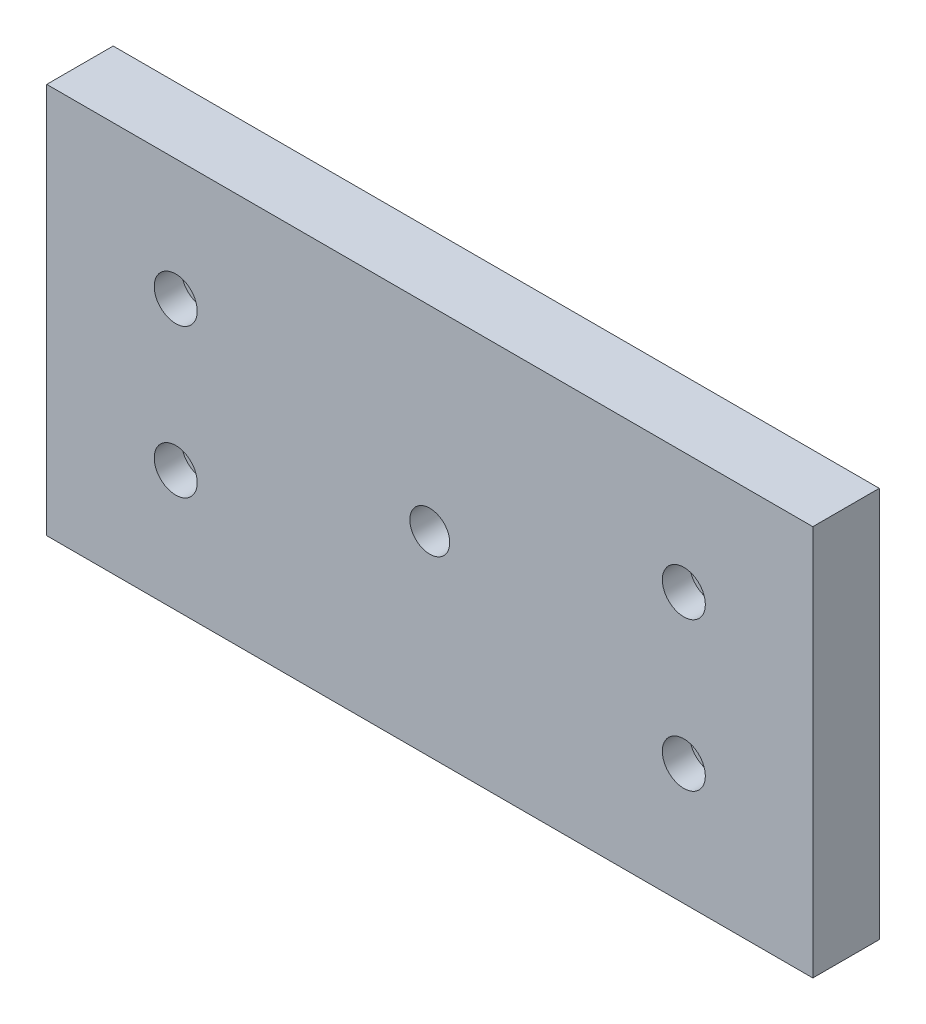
ISO-10303-21;
HEADER;
FILE_DESCRIPTION(('STEP AP214'),'2;1');
FILE_NAME('part.step','',(''),(''),'','','');
FILE_SCHEMA(('AUTOMOTIVE_DESIGN { 1 0 10303 214 1 1 1 1 }'));
ENDSEC;
DATA;
#1=APPLICATION_CONTEXT('core data for automotive mechanical design processes');
#2=APPLICATION_PROTOCOL_DEFINITION('international standard','automotive_design',2000,#1);
#3=PRODUCT_CONTEXT('',#1,'mechanical');
#4=PRODUCT('Part','Part','',(#3));
#5=PRODUCT_RELATED_PRODUCT_CATEGORY('part','',(#4));
#6=PRODUCT_DEFINITION_FORMATION('','',#4);
#7=PRODUCT_DEFINITION_CONTEXT('part definition',#1,'design');
#8=PRODUCT_DEFINITION('design','',#6,#7);
#9=PRODUCT_DEFINITION_SHAPE('','',#8);
#10=(LENGTH_UNIT() NAMED_UNIT(*) SI_UNIT(.MILLI.,.METRE.));
#11=(NAMED_UNIT(*) PLANE_ANGLE_UNIT() SI_UNIT($,.RADIAN.));
#12=(NAMED_UNIT(*) SI_UNIT($,.STERADIAN.) SOLID_ANGLE_UNIT());
#13=UNCERTAINTY_MEASURE_WITH_UNIT(LENGTH_MEASURE(1.E-05),#10,'distance_accuracy_value','');
#14=(GEOMETRIC_REPRESENTATION_CONTEXT(3) GLOBAL_UNCERTAINTY_ASSIGNED_CONTEXT((#13)) GLOBAL_UNIT_ASSIGNED_CONTEXT((#10,
#11,#12)) REPRESENTATION_CONTEXT('',''));
#15=CARTESIAN_POINT('',(0.,0.,0.));
#16=DIRECTION('',(0.,0.,1.));
#17=DIRECTION('',(1.,0.,0.));
#18=AXIS2_PLACEMENT_3D('',#15,#16,#17);
#19=CARTESIAN_POINT('',(0.,0.,17.));
#20=DIRECTION('',(1.,0.,0.));
#21=DIRECTION('',(0.,0.,-1.));
#22=AXIS2_PLACEMENT_3D('',#19,#20,#21);
#23=PLANE('',#22);
#24=DIRECTION('',(0.,-1.,0.));
#25=VECTOR('',#24,1.);
#26=CARTESIAN_POINT('',(0.,0.,0.));
#27=LINE('',#26,#25);
#28=CARTESIAN_POINT('',(0.,100.,0.));
#29=VERTEX_POINT('',#28);
#30=CARTESIAN_POINT('',(0.,0.,0.));
#31=VERTEX_POINT('',#30);
#32=EDGE_CURVE('E96',#29,#31,#27,.T.);
#33=ORIENTED_EDGE('',*,*,#32,.T.);
#34=DIRECTION('',(0.,0.,-1.));
#35=VECTOR('',#34,1.);
#36=CARTESIAN_POINT('',(0.,0.,17.));
#37=LINE('',#36,#35);
#38=CARTESIAN_POINT('',(0.,0.,17.));
#39=VERTEX_POINT('',#38);
#40=EDGE_CURVE('E11',#39,#31,#37,.T.);
#41=ORIENTED_EDGE('',*,*,#40,.F.);
#42=DIRECTION('',(0.,-1.,0.));
#43=VECTOR('',#42,1.);
#44=CARTESIAN_POINT('',(0.,0.,17.));
#45=LINE('',#44,#43);
#46=CARTESIAN_POINT('',(0.,100.,17.));
#47=VERTEX_POINT('',#46);
#48=EDGE_CURVE('E111',#47,#39,#45,.T.);
#49=ORIENTED_EDGE('',*,*,#48,.F.);
#50=DIRECTION('',(0.,0.,-1.));
#51=VECTOR('',#50,1.);
#52=CARTESIAN_POINT('',(0.,100.,17.));
#53=LINE('',#52,#51);
#54=EDGE_CURVE('E117',#47,#29,#53,.T.);
#55=ORIENTED_EDGE('',*,*,#54,.T.);
#56=EDGE_LOOP('',(#33,#41,#49,#55));
#57=FACE_BOUND('',#56,.T.);
#58=ADVANCED_FACE('F41',(#57),#23,.F.);
#59=CARTESIAN_POINT('',(0.,0.,17.));
#60=DIRECTION('',(0.,1.,0.));
#61=DIRECTION('',(0.,0.,1.));
#62=AXIS2_PLACEMENT_3D('',#59,#60,#61);
#63=PLANE('',#62);
#64=DIRECTION('',(1.,0.,0.));
#65=VECTOR('',#64,1.);
#66=CARTESIAN_POINT('',(0.,0.,0.));
#67=LINE('',#66,#65);
#68=CARTESIAN_POINT('',(196.,0.,0.));
#69=VERTEX_POINT('',#68);
#70=EDGE_CURVE('E105',#31,#69,#67,.T.);
#71=ORIENTED_EDGE('',*,*,#70,.T.);
#72=DIRECTION('',(0.,0.,-1.));
#73=VECTOR('',#72,1.);
#74=CARTESIAN_POINT('',(196.,0.,17.));
#75=LINE('',#74,#73);
#76=CARTESIAN_POINT('',(196.,0.,17.));
#77=VERTEX_POINT('',#76);
#78=EDGE_CURVE('E48',#77,#69,#75,.T.);
#79=ORIENTED_EDGE('',*,*,#78,.F.);
#80=DIRECTION('',(1.,0.,0.));
#81=VECTOR('',#80,1.);
#82=CARTESIAN_POINT('',(0.,0.,17.));
#83=LINE('',#82,#81);
#84=EDGE_CURVE('E113',#39,#77,#83,.T.);
#85=ORIENTED_EDGE('',*,*,#84,.F.);
#86=ORIENTED_EDGE('',*,*,#40,.T.);
#87=EDGE_LOOP('',(#71,#79,#85,#86));
#88=FACE_BOUND('',#87,.T.);
#89=ADVANCED_FACE('F138',(#88),#63,.F.);
#90=CARTESIAN_POINT('',(196.,0.,17.));
#91=DIRECTION('',(-1.,0.,0.));
#92=DIRECTION('',(0.,0.,1.));
#93=AXIS2_PLACEMENT_3D('',#90,#91,#92);
#94=PLANE('',#93);
#95=DIRECTION('',(0.,1.,0.));
#96=VECTOR('',#95,1.);
#97=CARTESIAN_POINT('',(196.,0.,0.));
#98=LINE('',#97,#96);
#99=CARTESIAN_POINT('',(196.,100.,0.));
#100=VERTEX_POINT('',#99);
#101=EDGE_CURVE('E107',#69,#100,#98,.T.);
#102=ORIENTED_EDGE('',*,*,#101,.T.);
#103=DIRECTION('',(0.,0.,-1.));
#104=VECTOR('',#103,1.);
#105=CARTESIAN_POINT('',(196.,100.,17.));
#106=LINE('',#105,#104);
#107=CARTESIAN_POINT('',(196.,100.,17.));
#108=VERTEX_POINT('',#107);
#109=EDGE_CURVE('E120',#108,#100,#106,.T.);
#110=ORIENTED_EDGE('',*,*,#109,.F.);
#111=DIRECTION('',(0.,1.,0.));
#112=VECTOR('',#111,1.);
#113=CARTESIAN_POINT('',(196.,0.,17.));
#114=LINE('',#113,#112);
#115=EDGE_CURVE('E60',#77,#108,#114,.T.);
#116=ORIENTED_EDGE('',*,*,#115,.F.);
#117=ORIENTED_EDGE('',*,*,#78,.T.);
#118=EDGE_LOOP('',(#102,#110,#116,#117));
#119=FACE_BOUND('',#118,.T.);
#120=ADVANCED_FACE('F126',(#119),#94,.F.);
#121=CARTESIAN_POINT('',(0.,100.,17.));
#122=DIRECTION('',(0.,-1.,0.));
#123=DIRECTION('',(0.,0.,-1.));
#124=AXIS2_PLACEMENT_3D('',#121,#122,#123);
#125=PLANE('',#124);
#126=DIRECTION('',(-1.,0.,0.));
#127=VECTOR('',#126,1.);
#128=CARTESIAN_POINT('',(0.,100.,0.));
#129=LINE('',#128,#127);
#130=EDGE_CURVE('E109',#100,#29,#129,.T.);
#131=ORIENTED_EDGE('',*,*,#130,.T.);
#132=ORIENTED_EDGE('',*,*,#54,.F.);
#133=DIRECTION('',(-1.,0.,0.));
#134=VECTOR('',#133,1.);
#135=CARTESIAN_POINT('',(0.,100.,17.));
#136=LINE('',#135,#134);
#137=EDGE_CURVE('E55',#108,#47,#136,.T.);
#138=ORIENTED_EDGE('',*,*,#137,.F.);
#139=ORIENTED_EDGE('',*,*,#109,.T.);
#140=EDGE_LOOP('',(#131,#132,#138,#139));
#141=FACE_BOUND('',#140,.T.);
#142=ADVANCED_FACE('F133',(#141),#125,.F.);
#143=CARTESIAN_POINT('',(0.,100.,17.));
#144=DIRECTION('',(0.,0.,-1.));
#145=DIRECTION('',(-1.,0.,0.));
#146=AXIS2_PLACEMENT_3D('',#143,#144,#145);
#147=PLANE('',#146);
#148=CARTESIAN_POINT('',(33.,69.,17.));
#149=DIRECTION('',(0.,0.,1.));
#150=DIRECTION('',(1.,0.,0.));
#151=AXIS2_PLACEMENT_3D('',#148,#149,#150);
#152=CIRCLE('',#151,5.49999999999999);
#153=CARTESIAN_POINT('',(38.5,69.,17.));
#154=VERTEX_POINT('',#153);
#155=EDGE_CURVE('E210',#154,#154,#152,.T.);
#156=ORIENTED_EDGE('',*,*,#155,.F.);
#157=EDGE_LOOP('',(#156));
#158=FACE_BOUND('',#157,.T.);
#159=CARTESIAN_POINT('',(163.,69.,17.));
#160=DIRECTION('',(0.,0.,1.));
#161=DIRECTION('',(1.,0.,0.));
#162=AXIS2_PLACEMENT_3D('',#159,#160,#161);
#163=CIRCLE('',#162,5.50000000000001);
#164=CARTESIAN_POINT('',(168.5,69.,17.));
#165=VERTEX_POINT('',#164);
#166=EDGE_CURVE('E220',#165,#165,#163,.T.);
#167=ORIENTED_EDGE('',*,*,#166,.F.);
#168=EDGE_LOOP('',(#167));
#169=FACE_BOUND('',#168,.T.);
#170=CARTESIAN_POINT('',(33.,31.,17.));
#171=DIRECTION('',(0.,0.,1.));
#172=DIRECTION('',(1.,0.,0.));
#173=AXIS2_PLACEMENT_3D('',#170,#171,#172);
#174=CIRCLE('',#173,5.49999999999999);
#175=CARTESIAN_POINT('',(38.5,31.,17.));
#176=VERTEX_POINT('',#175);
#177=EDGE_CURVE('E232',#176,#176,#174,.T.);
#178=ORIENTED_EDGE('',*,*,#177,.F.);
#179=EDGE_LOOP('',(#178));
#180=FACE_BOUND('',#179,.T.);
#181=CARTESIAN_POINT('',(163.,31.,17.));
#182=DIRECTION('',(0.,0.,1.));
#183=DIRECTION('',(1.,0.,0.));
#184=AXIS2_PLACEMENT_3D('',#181,#182,#183);
#185=CIRCLE('',#184,5.50000000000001);
#186=CARTESIAN_POINT('',(168.5,31.,17.));
#187=VERTEX_POINT('',#186);
#188=EDGE_CURVE('E244',#187,#187,#185,.T.);
#189=ORIENTED_EDGE('',*,*,#188,.F.);
#190=EDGE_LOOP('',(#189));
#191=FACE_BOUND('',#190,.T.);
#192=CARTESIAN_POINT('',(98.,50.,17.));
#193=DIRECTION('',(0.,0.,1.));
#194=DIRECTION('',(1.,0.,0.));
#195=AXIS2_PLACEMENT_3D('',#192,#193,#194);
#196=CIRCLE('',#195,5.09999999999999);
#197=CARTESIAN_POINT('',(103.1,50.,17.));
#198=VERTEX_POINT('',#197);
#199=EDGE_CURVE('E92',#198,#198,#196,.T.);
#200=ORIENTED_EDGE('',*,*,#199,.F.);
#201=EDGE_LOOP('',(#200));
#202=FACE_BOUND('',#201,.T.);
#203=ORIENTED_EDGE('',*,*,#48,.T.);
#204=ORIENTED_EDGE('',*,*,#84,.T.);
#205=ORIENTED_EDGE('',*,*,#115,.T.);
#206=ORIENTED_EDGE('',*,*,#137,.T.);
#207=EDGE_LOOP('',(#203,#204,#205,#206));
#208=FACE_BOUND('',#207,.T.);
#209=ADVANCED_FACE('F137',(#158,#169,#180,#191,#202,#208),#147,.F.);
#210=CARTESIAN_POINT('',(0.,100.,0.));
#211=DIRECTION('',(0.,0.,-1.));
#212=DIRECTION('',(-1.,0.,0.));
#213=AXIS2_PLACEMENT_3D('',#210,#211,#212);
#214=PLANE('',#213);
#215=CARTESIAN_POINT('',(33.,69.,0.));
#216=DIRECTION('',(0.,0.,1.));
#217=DIRECTION('',(1.,0.,0.));
#218=AXIS2_PLACEMENT_3D('',#215,#216,#217);
#219=CIRCLE('',#218,3.3);
#220=CARTESIAN_POINT('',(36.3,69.,0.));
#221=VERTEX_POINT('',#220);
#222=EDGE_CURVE('E217',#221,#221,#219,.T.);
#223=ORIENTED_EDGE('',*,*,#222,.T.);
#224=EDGE_LOOP('',(#223));
#225=FACE_BOUND('',#224,.T.);
#226=CARTESIAN_POINT('',(163.,69.,0.));
#227=DIRECTION('',(0.,0.,1.));
#228=DIRECTION('',(1.,0.,0.));
#229=AXIS2_PLACEMENT_3D('',#226,#227,#228);
#230=CIRCLE('',#229,3.3);
#231=CARTESIAN_POINT('',(166.3,69.,0.));
#232=VERTEX_POINT('',#231);
#233=EDGE_CURVE('E229',#232,#232,#230,.T.);
#234=ORIENTED_EDGE('',*,*,#233,.T.);
#235=EDGE_LOOP('',(#234));
#236=FACE_BOUND('',#235,.T.);
#237=CARTESIAN_POINT('',(33.,31.,0.));
#238=DIRECTION('',(0.,0.,1.));
#239=DIRECTION('',(1.,0.,0.));
#240=AXIS2_PLACEMENT_3D('',#237,#238,#239);
#241=CIRCLE('',#240,3.3);
#242=CARTESIAN_POINT('',(36.3,31.,0.));
#243=VERTEX_POINT('',#242);
#244=EDGE_CURVE('E241',#243,#243,#241,.T.);
#245=ORIENTED_EDGE('',*,*,#244,.T.);
#246=EDGE_LOOP('',(#245));
#247=FACE_BOUND('',#246,.T.);
#248=CARTESIAN_POINT('',(163.,31.,0.));
#249=DIRECTION('',(0.,0.,1.));
#250=DIRECTION('',(1.,0.,0.));
#251=AXIS2_PLACEMENT_3D('',#248,#249,#250);
#252=CIRCLE('',#251,3.3);
#253=CARTESIAN_POINT('',(166.3,31.,0.));
#254=VERTEX_POINT('',#253);
#255=EDGE_CURVE('E93',#254,#254,#252,.T.);
#256=ORIENTED_EDGE('',*,*,#255,.T.);
#257=EDGE_LOOP('',(#256));
#258=FACE_BOUND('',#257,.T.);
#259=ORIENTED_EDGE('',*,*,#32,.F.);
#260=ORIENTED_EDGE('',*,*,#130,.F.);
#261=ORIENTED_EDGE('',*,*,#101,.F.);
#262=ORIENTED_EDGE('',*,*,#70,.F.);
#263=EDGE_LOOP('',(#259,#260,#261,#262));
#264=FACE_BOUND('',#263,.T.);
#265=ADVANCED_FACE('F131',(#225,#236,#247,#258,#264),#214,.T.);
#266=CARTESIAN_POINT('',(98.,50.,17.));
#267=DIRECTION('',(0.,0.,1.));
#268=DIRECTION('',(1.,0.,0.));
#269=AXIS2_PLACEMENT_3D('',#266,#267,#268);
#270=CYLINDRICAL_SURFACE('',#269,5.09999999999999);
#271=CARTESIAN_POINT('',(98.,50.,3.74999999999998));
#272=DIRECTION('',(0.,0.,1.));
#273=DIRECTION('',(1.,0.,0.));
#274=AXIS2_PLACEMENT_3D('',#271,#272,#273);
#275=CIRCLE('',#274,5.09999999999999);
#276=CARTESIAN_POINT('',(103.1,50.,3.74999999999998));
#277=VERTEX_POINT('',#276);
#278=EDGE_CURVE('E90',#277,#277,#275,.T.);
#279=ORIENTED_EDGE('',*,*,#278,.F.);
#280=EDGE_LOOP('',(#279));
#281=FACE_BOUND('',#280,.T.);
#282=ORIENTED_EDGE('',*,*,#199,.T.);
#283=EDGE_LOOP('',(#282));
#284=FACE_BOUND('',#283,.T.);
#285=ADVANCED_FACE('F86',(#281,#284),#270,.F.);
#286=CARTESIAN_POINT('',(98.,50.,3.74999999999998));
#287=DIRECTION('',(0.,0.,1.));
#288=DIRECTION('',(1.,0.,0.));
#289=AXIS2_PLACEMENT_3D('',#286,#287,#288);
#290=CONICAL_SURFACE('',#289,5.09999999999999,1.02974425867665);
#291=CARTESIAN_POINT('',(98.,50.,0.685610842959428));
#292=VERTEX_POINT('',#291);
#293=VERTEX_LOOP('',#292);
#294=FACE_BOUND('',#293,.T.);
#295=ORIENTED_EDGE('',*,*,#278,.T.);
#296=EDGE_LOOP('',(#295));
#297=FACE_BOUND('',#296,.T.);
#298=ADVANCED_FACE('F82',(#294,#297),#290,.F.);
#299=CARTESIAN_POINT('',(163.,31.,17.));
#300=DIRECTION('',(0.,0.,1.));
#301=DIRECTION('',(1.,0.,0.));
#302=AXIS2_PLACEMENT_3D('',#299,#300,#301);
#303=CYLINDRICAL_SURFACE('',#302,3.3);
#304=ORIENTED_EDGE('',*,*,#255,.F.);
#305=EDGE_LOOP('',(#304));
#306=FACE_BOUND('',#305,.T.);
#307=CARTESIAN_POINT('',(163.,31.,10.));
#308=DIRECTION('',(0.,0.,1.));
#309=DIRECTION('',(1.,0.,0.));
#310=AXIS2_PLACEMENT_3D('',#307,#308,#309);
#311=CIRCLE('',#310,3.3);
#312=CARTESIAN_POINT('',(166.3,31.,10.));
#313=VERTEX_POINT('',#312);
#314=EDGE_CURVE('E99',#313,#313,#311,.T.);
#315=ORIENTED_EDGE('',*,*,#314,.T.);
#316=EDGE_LOOP('',(#315));
#317=FACE_BOUND('',#316,.T.);
#318=ADVANCED_FACE('F85',(#306,#317),#303,.F.);
#319=CARTESIAN_POINT('',(166.3,31.,10.));
#320=DIRECTION('',(0.,0.,-1.));
#321=DIRECTION('',(-1.,0.,0.));
#322=AXIS2_PLACEMENT_3D('',#319,#320,#321);
#323=PLANE('',#322);
#324=ORIENTED_EDGE('',*,*,#314,.F.);
#325=EDGE_LOOP('',(#324));
#326=FACE_BOUND('',#325,.T.);
#327=CARTESIAN_POINT('',(163.,31.,10.));
#328=DIRECTION('',(0.,0.,1.));
#329=DIRECTION('',(1.,0.,0.));
#330=AXIS2_PLACEMENT_3D('',#327,#328,#329);
#331=CIRCLE('',#330,5.50000000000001);
#332=CARTESIAN_POINT('',(168.5,31.,10.));
#333=VERTEX_POINT('',#332);
#334=EDGE_CURVE('E247',#333,#333,#331,.T.);
#335=ORIENTED_EDGE('',*,*,#334,.T.);
#336=EDGE_LOOP('',(#335));
#337=FACE_BOUND('',#336,.T.);
#338=ADVANCED_FACE('F158',(#326,#337),#323,.F.);
#339=CARTESIAN_POINT('',(163.,31.,17.));
#340=DIRECTION('',(0.,0.,1.));
#341=DIRECTION('',(1.,0.,0.));
#342=AXIS2_PLACEMENT_3D('',#339,#340,#341);
#343=CYLINDRICAL_SURFACE('',#342,5.50000000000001);
#344=ORIENTED_EDGE('',*,*,#334,.F.);
#345=EDGE_LOOP('',(#344));
#346=FACE_BOUND('',#345,.T.);
#347=ORIENTED_EDGE('',*,*,#188,.T.);
#348=EDGE_LOOP('',(#347));
#349=FACE_BOUND('',#348,.T.);
#350=ADVANCED_FACE('F162',(#346,#349),#343,.F.);
#351=CARTESIAN_POINT('',(33.,31.,17.));
#352=DIRECTION('',(0.,0.,1.));
#353=DIRECTION('',(1.,0.,0.));
#354=AXIS2_PLACEMENT_3D('',#351,#352,#353);
#355=CYLINDRICAL_SURFACE('',#354,3.3);
#356=ORIENTED_EDGE('',*,*,#244,.F.);
#357=EDGE_LOOP('',(#356));
#358=FACE_BOUND('',#357,.T.);
#359=CARTESIAN_POINT('',(33.,31.,10.));
#360=DIRECTION('',(0.,0.,1.));
#361=DIRECTION('',(1.,0.,0.));
#362=AXIS2_PLACEMENT_3D('',#359,#360,#361);
#363=CIRCLE('',#362,3.3);
#364=CARTESIAN_POINT('',(36.3,31.,10.));
#365=VERTEX_POINT('',#364);
#366=EDGE_CURVE('E238',#365,#365,#363,.T.);
#367=ORIENTED_EDGE('',*,*,#366,.T.);
#368=EDGE_LOOP('',(#367));
#369=FACE_BOUND('',#368,.T.);
#370=ADVANCED_FACE('F166',(#358,#369),#355,.F.);
#371=CARTESIAN_POINT('',(36.3,31.,10.));
#372=DIRECTION('',(0.,0.,-1.));
#373=DIRECTION('',(-1.,0.,0.));
#374=AXIS2_PLACEMENT_3D('',#371,#372,#373);
#375=PLANE('',#374);
#376=ORIENTED_EDGE('',*,*,#366,.F.);
#377=EDGE_LOOP('',(#376));
#378=FACE_BOUND('',#377,.T.);
#379=CARTESIAN_POINT('',(33.,31.,10.));
#380=DIRECTION('',(0.,0.,1.));
#381=DIRECTION('',(1.,0.,0.));
#382=AXIS2_PLACEMENT_3D('',#379,#380,#381);
#383=CIRCLE('',#382,5.5);
#384=CARTESIAN_POINT('',(38.5,31.,10.));
#385=VERTEX_POINT('',#384);
#386=EDGE_CURVE('E235',#385,#385,#383,.T.);
#387=ORIENTED_EDGE('',*,*,#386,.T.);
#388=EDGE_LOOP('',(#387));
#389=FACE_BOUND('',#388,.T.);
#390=ADVANCED_FACE('F170',(#378,#389),#375,.F.);
#391=CARTESIAN_POINT('',(33.,31.,17.));
#392=DIRECTION('',(0.,0.,1.));
#393=DIRECTION('',(1.,0.,0.));
#394=AXIS2_PLACEMENT_3D('',#391,#392,#393);
#395=CYLINDRICAL_SURFACE('',#394,5.49999999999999);
#396=ORIENTED_EDGE('',*,*,#386,.F.);
#397=EDGE_LOOP('',(#396));
#398=FACE_BOUND('',#397,.T.);
#399=ORIENTED_EDGE('',*,*,#177,.T.);
#400=EDGE_LOOP('',(#399));
#401=FACE_BOUND('',#400,.T.);
#402=ADVANCED_FACE('F174',(#398,#401),#395,.F.);
#403=CARTESIAN_POINT('',(163.,69.,17.));
#404=DIRECTION('',(0.,0.,1.));
#405=DIRECTION('',(1.,0.,0.));
#406=AXIS2_PLACEMENT_3D('',#403,#404,#405);
#407=CYLINDRICAL_SURFACE('',#406,3.3);
#408=ORIENTED_EDGE('',*,*,#233,.F.);
#409=EDGE_LOOP('',(#408));
#410=FACE_BOUND('',#409,.T.);
#411=CARTESIAN_POINT('',(163.,69.,10.));
#412=DIRECTION('',(0.,0.,1.));
#413=DIRECTION('',(1.,0.,0.));
#414=AXIS2_PLACEMENT_3D('',#411,#412,#413);
#415=CIRCLE('',#414,3.3);
#416=CARTESIAN_POINT('',(166.3,69.,10.));
#417=VERTEX_POINT('',#416);
#418=EDGE_CURVE('E226',#417,#417,#415,.T.);
#419=ORIENTED_EDGE('',*,*,#418,.T.);
#420=EDGE_LOOP('',(#419));
#421=FACE_BOUND('',#420,.T.);
#422=ADVANCED_FACE('F178',(#410,#421),#407,.F.);
#423=CARTESIAN_POINT('',(166.3,69.,10.));
#424=DIRECTION('',(0.,0.,-1.));
#425=DIRECTION('',(-1.,0.,0.));
#426=AXIS2_PLACEMENT_3D('',#423,#424,#425);
#427=PLANE('',#426);
#428=ORIENTED_EDGE('',*,*,#418,.F.);
#429=EDGE_LOOP('',(#428));
#430=FACE_BOUND('',#429,.T.);
#431=CARTESIAN_POINT('',(163.,69.,10.));
#432=DIRECTION('',(0.,0.,1.));
#433=DIRECTION('',(1.,0.,0.));
#434=AXIS2_PLACEMENT_3D('',#431,#432,#433);
#435=CIRCLE('',#434,5.50000000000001);
#436=CARTESIAN_POINT('',(168.5,69.,10.));
#437=VERTEX_POINT('',#436);
#438=EDGE_CURVE('E223',#437,#437,#435,.T.);
#439=ORIENTED_EDGE('',*,*,#438,.T.);
#440=EDGE_LOOP('',(#439));
#441=FACE_BOUND('',#440,.T.);
#442=ADVANCED_FACE('F182',(#430,#441),#427,.F.);
#443=CARTESIAN_POINT('',(163.,69.,17.));
#444=DIRECTION('',(0.,0.,1.));
#445=DIRECTION('',(1.,0.,0.));
#446=AXIS2_PLACEMENT_3D('',#443,#444,#445);
#447=CYLINDRICAL_SURFACE('',#446,5.50000000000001);
#448=ORIENTED_EDGE('',*,*,#438,.F.);
#449=EDGE_LOOP('',(#448));
#450=FACE_BOUND('',#449,.T.);
#451=ORIENTED_EDGE('',*,*,#166,.T.);
#452=EDGE_LOOP('',(#451));
#453=FACE_BOUND('',#452,.T.);
#454=ADVANCED_FACE('F186',(#450,#453),#447,.F.);
#455=CARTESIAN_POINT('',(33.,69.,17.));
#456=DIRECTION('',(0.,0.,1.));
#457=DIRECTION('',(1.,0.,0.));
#458=AXIS2_PLACEMENT_3D('',#455,#456,#457);
#459=CYLINDRICAL_SURFACE('',#458,3.3);
#460=ORIENTED_EDGE('',*,*,#222,.F.);
#461=EDGE_LOOP('',(#460));
#462=FACE_BOUND('',#461,.T.);
#463=CARTESIAN_POINT('',(33.,69.,10.));
#464=DIRECTION('',(0.,0.,1.));
#465=DIRECTION('',(1.,0.,0.));
#466=AXIS2_PLACEMENT_3D('',#463,#464,#465);
#467=CIRCLE('',#466,3.3);
#468=CARTESIAN_POINT('',(36.3,69.,10.));
#469=VERTEX_POINT('',#468);
#470=EDGE_CURVE('E212',#469,#469,#467,.T.);
#471=ORIENTED_EDGE('',*,*,#470,.T.);
#472=EDGE_LOOP('',(#471));
#473=FACE_BOUND('',#472,.T.);
#474=ADVANCED_FACE('F190',(#462,#473),#459,.F.);
#475=CARTESIAN_POINT('',(36.3,69.,10.));
#476=DIRECTION('',(0.,0.,-1.));
#477=DIRECTION('',(-1.,0.,0.));
#478=AXIS2_PLACEMENT_3D('',#475,#476,#477);
#479=PLANE('',#478);
#480=ORIENTED_EDGE('',*,*,#470,.F.);
#481=EDGE_LOOP('',(#480));
#482=FACE_BOUND('',#481,.T.);
#483=CARTESIAN_POINT('',(33.,69.,10.));
#484=DIRECTION('',(0.,0.,1.));
#485=DIRECTION('',(1.,0.,0.));
#486=AXIS2_PLACEMENT_3D('',#483,#484,#485);
#487=CIRCLE('',#486,5.5);
#488=CARTESIAN_POINT('',(38.5,69.,10.));
#489=VERTEX_POINT('',#488);
#490=EDGE_CURVE('E207',#489,#489,#487,.T.);
#491=ORIENTED_EDGE('',*,*,#490,.T.);
#492=EDGE_LOOP('',(#491));
#493=FACE_BOUND('',#492,.T.);
#494=ADVANCED_FACE('F194',(#482,#493),#479,.F.);
#495=CARTESIAN_POINT('',(33.,69.,17.));
#496=DIRECTION('',(0.,0.,1.));
#497=DIRECTION('',(1.,0.,0.));
#498=AXIS2_PLACEMENT_3D('',#495,#496,#497);
#499=CYLINDRICAL_SURFACE('',#498,5.49999999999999);
#500=ORIENTED_EDGE('',*,*,#490,.F.);
#501=EDGE_LOOP('',(#500));
#502=FACE_BOUND('',#501,.T.);
#503=ORIENTED_EDGE('',*,*,#155,.T.);
#504=EDGE_LOOP('',(#503));
#505=FACE_BOUND('',#504,.T.);
#506=ADVANCED_FACE('F198',(#502,#505),#499,.F.);
#507=CLOSED_SHELL('',(#58,#89,#120,#142,#209,#265,#285,#298,#318,#338,#350,#370,#390,#402,#422,
#442,#454,#474,#494,#506));
#508=MANIFOLD_SOLID_BREP('B2',#507);
#509=ADVANCED_BREP_SHAPE_REPRESENTATION('',(#18,#508),#14);
#510=SHAPE_DEFINITION_REPRESENTATION(#9,#509);
ENDSEC;
END-ISO-10303-21;
